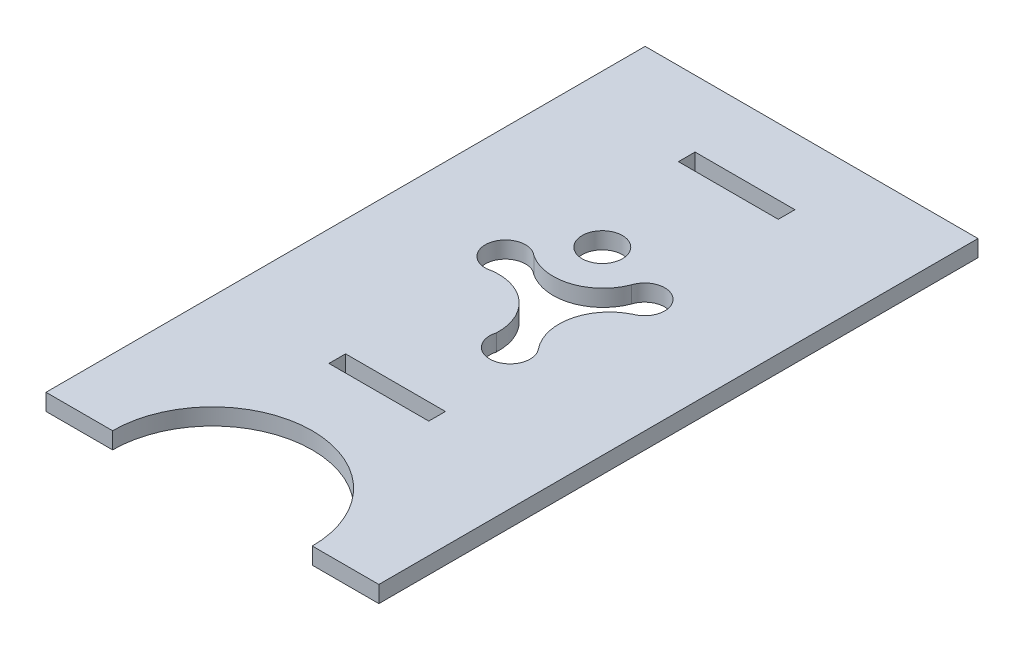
from build123d import *

# Parameters (mm, degrees)
CROQUIS1_W              = 30
CROQUIS1_H              = 5
SALIENTE_EXTRUIR1_DEPTH = 5
CROQUIS2_R              = 6.050623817
CORTAR_EXTRUIR1_DEPTH   = 5


with BuildPart() as part:
    # Croquis1 → Saliente-Extruir1 (new body)
    with BuildSketch(Plane(origin=(0, 0, 0), x_dir=(1, 0, 0), z_dir=(0, 1, 0))):
        with BuildLine():
            Line((365.516384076, -130.906361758), (385.516384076, -130.906361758))
            Line((385.516384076, -130.906361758), (385.516384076, 49.093638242))
            Line((385.516384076, 49.093638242), (285.516384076, 49.093638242))
            Line((285.516384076, 49.093638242), (285.516384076, -130.906361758))
            Line((285.516384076, -130.906361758), (305.516384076, -130.906361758))
            ThreePointArc((305.516384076, -130.906361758), (335.516384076, -100.906361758), (365.516384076, -130.906361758))
        make_face()
        with Locations((335.516384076, -78.406361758)):
            Rectangle(CROQUIS1_W, CROQUIS1_H, mode=Mode.SUBTRACT)
        with Locations((335.516384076, 26.593638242)):
            Rectangle(CROQUIS1_W, CROQUIS1_H, mode=Mode.SUBTRACT)
    extrude(amount=SALIENTE_EXTRUIR1_DEPTH)

    # Croquis2 → Cortar-Extruir1 (cut)
    with BuildSketch(Plane(origin=(0, 5, 0), x_dir=(1, 0, 0), z_dir=(0, 1, 0))):
        with Locations(Location((331.312352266, -9.577105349, 0), (0, 0, 270))):
            Circle(CROQUIS2_R)
        with BuildLine():
            ThreePointArc((353.340812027, -22.473720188), (355.413829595, -12.42613685), (345.49297624, -15.039181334))
            ThreePointArc((345.49297624, -15.039181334), (335.992370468, -23.884804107), (323.150194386, -21.991377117))
            ThreePointArc((323.150194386, -21.991377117), (313.24504017, -25.293365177), (320.977861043, -32.308968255))
            ThreePointArc((320.977861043, -32.308968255), (332.940154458, -36.182160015), (337.704600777, -47.818230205))
            ThreePointArc((337.704600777, -47.818230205), (344.776880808, -55.478757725), (348.18789709, -45.626560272))
            ThreePointArc((348.18789709, -45.626560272), (345.189830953, -32.809469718), (353.340812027, -22.473720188))
        make_face()
    extrude(amount=-CORTAR_EXTRUIR1_DEPTH, mode=Mode.SUBTRACT)


solid = part.part
